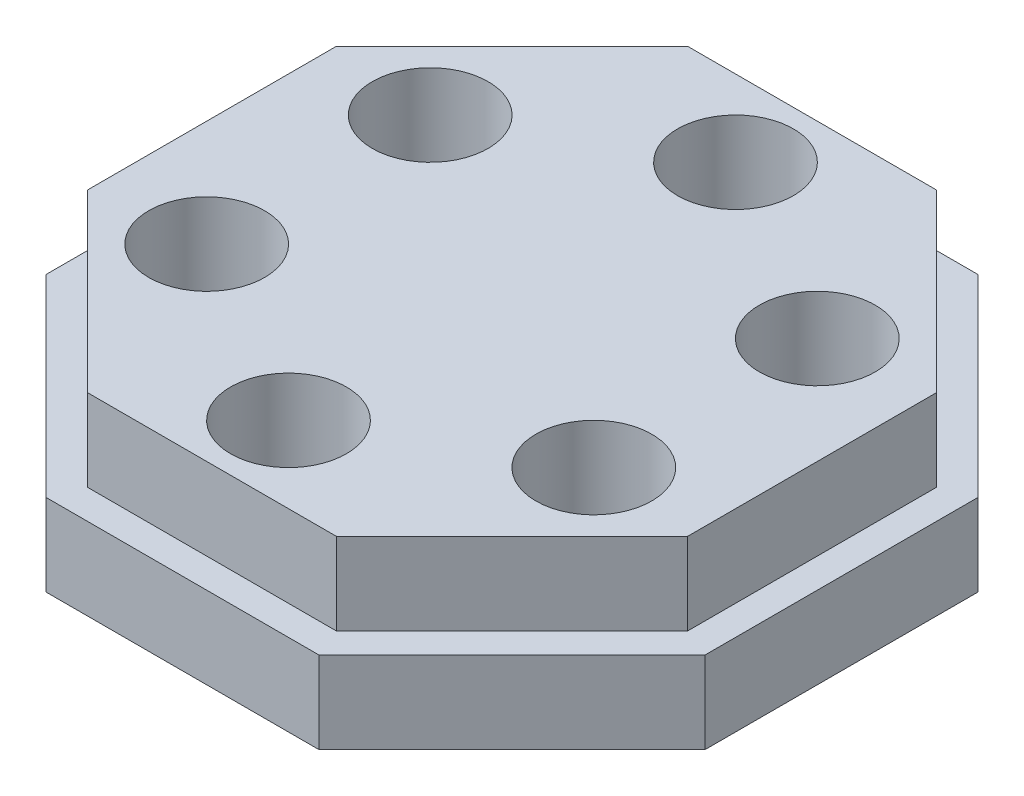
ISO-10303-21;
HEADER;
FILE_DESCRIPTION(('STEP AP214'),'2;1');
FILE_NAME('part.step','',(''),(''),'','','');
FILE_SCHEMA(('AUTOMOTIVE_DESIGN { 1 0 10303 214 1 1 1 1 }'));
ENDSEC;
DATA;
#1=APPLICATION_CONTEXT('core data for automotive mechanical design processes');
#2=APPLICATION_PROTOCOL_DEFINITION('international standard','automotive_design',2000,#1);
#3=PRODUCT_CONTEXT('',#1,'mechanical');
#4=PRODUCT('Part','Part','',(#3));
#5=PRODUCT_RELATED_PRODUCT_CATEGORY('part','',(#4));
#6=PRODUCT_DEFINITION_FORMATION('','',#4);
#7=PRODUCT_DEFINITION_CONTEXT('part definition',#1,'design');
#8=PRODUCT_DEFINITION('design','',#6,#7);
#9=PRODUCT_DEFINITION_SHAPE('','',#8);
#10=(LENGTH_UNIT() NAMED_UNIT(*) SI_UNIT(.MILLI.,.METRE.));
#11=(NAMED_UNIT(*) PLANE_ANGLE_UNIT() SI_UNIT($,.RADIAN.));
#12=(NAMED_UNIT(*) SI_UNIT($,.STERADIAN.) SOLID_ANGLE_UNIT());
#13=UNCERTAINTY_MEASURE_WITH_UNIT(LENGTH_MEASURE(1.E-05),#10,'distance_accuracy_value','');
#14=(GEOMETRIC_REPRESENTATION_CONTEXT(3) GLOBAL_UNCERTAINTY_ASSIGNED_CONTEXT((#13)) GLOBAL_UNIT_ASSIGNED_CONTEXT((#10,
#11,#12)) REPRESENTATION_CONTEXT('',''));
#15=CARTESIAN_POINT('',(0.,0.,0.));
#16=DIRECTION('',(0.,0.,1.));
#17=DIRECTION('',(1.,0.,0.));
#18=AXIS2_PLACEMENT_3D('',#15,#16,#17);
#19=CARTESIAN_POINT('',(0.,19.05,0.));
#20=DIRECTION('',(0.,-1.,0.));
#21=DIRECTION('',(0.,0.,-1.));
#22=AXIS2_PLACEMENT_3D('',#19,#20,#21);
#23=PLANE('',#22);
#24=DIRECTION('',(-0.707106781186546,0.,0.707106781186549));
#25=VECTOR('',#24,1.);
#26=CARTESIAN_POINT('',(-76.5809999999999,19.05,-31.7208888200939));
#27=LINE('',#26,#25);
#28=CARTESIAN_POINT('',(-31.720888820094,19.05,-76.5809999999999));
#29=VERTEX_POINT('',#28);
#30=CARTESIAN_POINT('',(-76.5809999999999,19.05,-31.7208888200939));
#31=VERTEX_POINT('',#30);
#32=EDGE_CURVE('E176',#29,#31,#27,.T.);
#33=ORIENTED_EDGE('',*,*,#32,.T.);
#34=DIRECTION('',(0.,0.,1.));
#35=VECTOR('',#34,1.);
#36=CARTESIAN_POINT('',(-76.5809999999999,19.05,31.7208888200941));
#37=LINE('',#36,#35);
#38=CARTESIAN_POINT('',(-76.5809999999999,19.05,31.7208888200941));
#39=VERTEX_POINT('',#38);
#40=EDGE_CURVE('E179',#31,#39,#37,.T.);
#41=ORIENTED_EDGE('',*,*,#40,.T.);
#42=DIRECTION('',(0.707106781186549,0.,0.707106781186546));
#43=VECTOR('',#42,1.);
#44=CARTESIAN_POINT('',(-31.7208888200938,19.05,76.581));
#45=LINE('',#44,#43);
#46=CARTESIAN_POINT('',(-31.7208888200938,19.05,76.581));
#47=VERTEX_POINT('',#46);
#48=EDGE_CURVE('E182',#39,#47,#45,.T.);
#49=ORIENTED_EDGE('',*,*,#48,.T.);
#50=DIRECTION('',(1.,0.,0.));
#51=VECTOR('',#50,1.);
#52=CARTESIAN_POINT('',(31.7208888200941,19.05,76.581));
#53=LINE('',#52,#51);
#54=CARTESIAN_POINT('',(31.7208888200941,19.05,76.581));
#55=VERTEX_POINT('',#54);
#56=EDGE_CURVE('E184',#47,#55,#53,.T.);
#57=ORIENTED_EDGE('',*,*,#56,.T.);
#58=DIRECTION('',(0.707106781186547,0.,-0.707106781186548));
#59=VECTOR('',#58,1.);
#60=CARTESIAN_POINT('',(76.5810000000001,19.05,31.720888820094));
#61=LINE('',#60,#59);
#62=CARTESIAN_POINT('',(76.5810000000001,19.05,31.720888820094));
#63=VERTEX_POINT('',#62);
#64=EDGE_CURVE('E186',#55,#63,#61,.T.);
#65=ORIENTED_EDGE('',*,*,#64,.T.);
#66=DIRECTION('',(0.,0.,-1.));
#67=VECTOR('',#66,1.);
#68=CARTESIAN_POINT('',(76.5810000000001,19.05,-31.720888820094));
#69=LINE('',#68,#67);
#70=CARTESIAN_POINT('',(76.5810000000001,19.05,-31.720888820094));
#71=VERTEX_POINT('',#70);
#72=EDGE_CURVE('E188',#63,#71,#69,.T.);
#73=ORIENTED_EDGE('',*,*,#72,.T.);
#74=DIRECTION('',(-0.707106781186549,0.,-0.707106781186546));
#75=VECTOR('',#74,1.);
#76=CARTESIAN_POINT('',(31.720888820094,19.05,-76.5809999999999));
#77=LINE('',#76,#75);
#78=CARTESIAN_POINT('',(31.720888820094,19.05,-76.5809999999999));
#79=VERTEX_POINT('',#78);
#80=EDGE_CURVE('E190',#71,#79,#77,.T.);
#81=ORIENTED_EDGE('',*,*,#80,.T.);
#82=DIRECTION('',(-1.,0.,0.));
#83=VECTOR('',#82,1.);
#84=CARTESIAN_POINT('',(-31.720888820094,19.05,-76.5809999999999));
#85=LINE('',#84,#83);
#86=EDGE_CURVE('E192',#79,#29,#85,.T.);
#87=ORIENTED_EDGE('',*,*,#86,.T.);
#88=EDGE_LOOP('',(#33,#41,#49,#57,#65,#73,#81,#87));
#89=FACE_BOUND('',#88,.T.);
#90=DIRECTION('',(-0.707106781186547,0.,0.707106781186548));
#91=VECTOR('',#90,1.);
#92=CARTESIAN_POINT('',(-69.723,19.05,-28.8802122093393));
#93=LINE('',#92,#91);
#94=CARTESIAN_POINT('',(-28.8802122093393,19.05,-69.723));
#95=VERTEX_POINT('',#94);
#96=CARTESIAN_POINT('',(-69.723,19.05,-28.8802122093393));
#97=VERTEX_POINT('',#96);
#98=EDGE_CURVE('E166',#95,#97,#93,.T.);
#99=ORIENTED_EDGE('',*,*,#98,.F.);
#100=DIRECTION('',(-1.,0.,0.));
#101=VECTOR('',#100,1.);
#102=CARTESIAN_POINT('',(-28.8802122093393,19.05,-69.723));
#103=LINE('',#102,#101);
#104=CARTESIAN_POINT('',(28.8802122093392,19.05,-69.723));
#105=VERTEX_POINT('',#104);
#106=EDGE_CURVE('E163',#105,#95,#103,.T.);
#107=ORIENTED_EDGE('',*,*,#106,.F.);
#108=DIRECTION('',(-0.707106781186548,0.,-0.707106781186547));
#109=VECTOR('',#108,1.);
#110=CARTESIAN_POINT('',(28.8802122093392,19.05,-69.723));
#111=LINE('',#110,#109);
#112=CARTESIAN_POINT('',(69.7229999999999,19.05,-28.8802122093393));
#113=VERTEX_POINT('',#112);
#114=EDGE_CURVE('E551',#113,#105,#111,.T.);
#115=ORIENTED_EDGE('',*,*,#114,.F.);
#116=DIRECTION('',(0.,0.,-1.));
#117=VECTOR('',#116,1.);
#118=CARTESIAN_POINT('',(69.7229999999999,19.05,-28.8802122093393));
#119=LINE('',#118,#117);
#120=CARTESIAN_POINT('',(69.7229999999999,19.05,28.8802122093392));
#121=VERTEX_POINT('',#120);
#122=EDGE_CURVE('E548',#121,#113,#119,.T.);
#123=ORIENTED_EDGE('',*,*,#122,.F.);
#124=DIRECTION('',(0.707106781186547,0.,-0.707106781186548));
#125=VECTOR('',#124,1.);
#126=CARTESIAN_POINT('',(69.7229999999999,19.05,28.8802122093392));
#127=LINE('',#126,#125);
#128=CARTESIAN_POINT('',(28.8802122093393,19.05,69.7229999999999));
#129=VERTEX_POINT('',#128);
#130=EDGE_CURVE('E545',#129,#121,#127,.T.);
#131=ORIENTED_EDGE('',*,*,#130,.F.);
#132=DIRECTION('',(1.,0.,0.));
#133=VECTOR('',#132,1.);
#134=CARTESIAN_POINT('',(28.8802122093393,19.05,69.7229999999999));
#135=LINE('',#134,#133);
#136=CARTESIAN_POINT('',(-28.8802122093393,19.05,69.7229999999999));
#137=VERTEX_POINT('',#136);
#138=EDGE_CURVE('E542',#137,#129,#135,.T.);
#139=ORIENTED_EDGE('',*,*,#138,.F.);
#140=DIRECTION('',(0.707106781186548,0.,0.707106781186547));
#141=VECTOR('',#140,1.);
#142=CARTESIAN_POINT('',(-28.8802122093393,19.05,69.7229999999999));
#143=LINE('',#142,#141);
#144=CARTESIAN_POINT('',(-69.723,19.05,28.8802122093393));
#145=VERTEX_POINT('',#144);
#146=EDGE_CURVE('E53',#145,#137,#143,.T.);
#147=ORIENTED_EDGE('',*,*,#146,.F.);
#148=DIRECTION('',(0.,0.,1.));
#149=VECTOR('',#148,1.);
#150=CARTESIAN_POINT('',(-69.723,19.05,28.8802122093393));
#151=LINE('',#150,#149);
#152=EDGE_CURVE('E48',#97,#145,#151,.T.);
#153=ORIENTED_EDGE('',*,*,#152,.F.);
#154=EDGE_LOOP('',(#99,#107,#115,#123,#131,#139,#147,#153));
#155=FACE_BOUND('',#154,.T.);
#156=ADVANCED_FACE('F33',(#89,#155),#23,.F.);
#157=CARTESIAN_POINT('',(-76.5809999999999,19.05,-31.7208888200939));
#158=DIRECTION('',(0.707106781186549,0.,0.707106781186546));
#159=DIRECTION('',(0.707106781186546,0.,-0.707106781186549));
#160=AXIS2_PLACEMENT_3D('',#157,#158,#159);
#161=PLANE('',#160);
#162=DIRECTION('',(-0.707106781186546,0.,0.707106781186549));
#163=VECTOR('',#162,1.);
#164=CARTESIAN_POINT('',(-76.5809999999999,0.,-31.7208888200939));
#165=LINE('',#164,#163);
#166=CARTESIAN_POINT('',(-31.720888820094,0.,-76.5809999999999));
#167=VERTEX_POINT('',#166);
#168=CARTESIAN_POINT('',(-76.5809999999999,0.,-31.7208888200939));
#169=VERTEX_POINT('',#168);
#170=EDGE_CURVE('E167',#167,#169,#165,.T.);
#171=ORIENTED_EDGE('',*,*,#170,.T.);
#172=DIRECTION('',(0.,-1.,0.));
#173=VECTOR('',#172,1.);
#174=CARTESIAN_POINT('',(-76.5809999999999,19.05,-31.7208888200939));
#175=LINE('',#174,#173);
#176=EDGE_CURVE('E11',#31,#169,#175,.T.);
#177=ORIENTED_EDGE('',*,*,#176,.F.);
#178=ORIENTED_EDGE('',*,*,#32,.F.);
#179=DIRECTION('',(0.,-1.,0.));
#180=VECTOR('',#179,1.);
#181=CARTESIAN_POINT('',(-31.720888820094,19.05,-76.5809999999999));
#182=LINE('',#181,#180);
#183=EDGE_CURVE('E193',#29,#167,#182,.T.);
#184=ORIENTED_EDGE('',*,*,#183,.T.);
#185=EDGE_LOOP('',(#171,#177,#178,#184));
#186=FACE_BOUND('',#185,.T.);
#187=ADVANCED_FACE('F35',(#186),#161,.F.);
#188=CARTESIAN_POINT('',(-76.5809999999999,19.05,31.7208888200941));
#189=DIRECTION('',(1.,0.,0.));
#190=DIRECTION('',(0.,0.,-1.));
#191=AXIS2_PLACEMENT_3D('',#188,#189,#190);
#192=PLANE('',#191);
#193=DIRECTION('',(0.,0.,1.));
#194=VECTOR('',#193,1.);
#195=CARTESIAN_POINT('',(-76.5809999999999,0.,31.7208888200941));
#196=LINE('',#195,#194);
#197=CARTESIAN_POINT('',(-76.5809999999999,0.,31.7208888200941));
#198=VERTEX_POINT('',#197);
#199=EDGE_CURVE('E170',#169,#198,#196,.T.);
#200=ORIENTED_EDGE('',*,*,#199,.T.);
#201=DIRECTION('',(0.,-1.,0.));
#202=VECTOR('',#201,1.);
#203=CARTESIAN_POINT('',(-76.5809999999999,19.05,31.7208888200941));
#204=LINE('',#203,#202);
#205=EDGE_CURVE('E41',#39,#198,#204,.T.);
#206=ORIENTED_EDGE('',*,*,#205,.F.);
#207=ORIENTED_EDGE('',*,*,#40,.F.);
#208=ORIENTED_EDGE('',*,*,#176,.T.);
#209=EDGE_LOOP('',(#200,#206,#207,#208));
#210=FACE_BOUND('',#209,.T.);
#211=ADVANCED_FACE('F250',(#210),#192,.F.);
#212=CARTESIAN_POINT('',(-31.7208888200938,19.05,76.581));
#213=DIRECTION('',(0.707106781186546,0.,-0.707106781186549));
#214=DIRECTION('',(-0.707106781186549,0.,-0.707106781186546));
#215=AXIS2_PLACEMENT_3D('',#212,#213,#214);
#216=PLANE('',#215);
#217=DIRECTION('',(0.707106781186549,0.,0.707106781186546));
#218=VECTOR('',#217,1.);
#219=CARTESIAN_POINT('',(-31.7208888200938,0.,76.581));
#220=LINE('',#219,#218);
#221=CARTESIAN_POINT('',(-31.7208888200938,0.,76.581));
#222=VERTEX_POINT('',#221);
#223=EDGE_CURVE('E196',#198,#222,#220,.T.);
#224=ORIENTED_EDGE('',*,*,#223,.T.);
#225=DIRECTION('',(0.,-1.,0.));
#226=VECTOR('',#225,1.);
#227=CARTESIAN_POINT('',(-31.7208888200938,19.05,76.581));
#228=LINE('',#227,#226);
#229=EDGE_CURVE('E221',#47,#222,#228,.T.);
#230=ORIENTED_EDGE('',*,*,#229,.F.);
#231=ORIENTED_EDGE('',*,*,#48,.F.);
#232=ORIENTED_EDGE('',*,*,#205,.T.);
#233=EDGE_LOOP('',(#224,#230,#231,#232));
#234=FACE_BOUND('',#233,.T.);
#235=ADVANCED_FACE('F228',(#234),#216,.F.);
#236=CARTESIAN_POINT('',(31.7208888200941,19.05,76.581));
#237=DIRECTION('',(0.,0.,-1.));
#238=DIRECTION('',(-1.,0.,0.));
#239=AXIS2_PLACEMENT_3D('',#236,#237,#238);
#240=PLANE('',#239);
#241=DIRECTION('',(1.,0.,0.));
#242=VECTOR('',#241,1.);
#243=CARTESIAN_POINT('',(31.7208888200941,0.,76.581));
#244=LINE('',#243,#242);
#245=CARTESIAN_POINT('',(31.7208888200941,0.,76.581));
#246=VERTEX_POINT('',#245);
#247=EDGE_CURVE('E198',#222,#246,#244,.T.);
#248=ORIENTED_EDGE('',*,*,#247,.T.);
#249=DIRECTION('',(0.,-1.,0.));
#250=VECTOR('',#249,1.);
#251=CARTESIAN_POINT('',(31.7208888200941,19.05,76.581));
#252=LINE('',#251,#250);
#253=EDGE_CURVE('E218',#55,#246,#252,.T.);
#254=ORIENTED_EDGE('',*,*,#253,.F.);
#255=ORIENTED_EDGE('',*,*,#56,.F.);
#256=ORIENTED_EDGE('',*,*,#229,.T.);
#257=EDGE_LOOP('',(#248,#254,#255,#256));
#258=FACE_BOUND('',#257,.T.);
#259=ADVANCED_FACE('F239',(#258),#240,.F.);
#260=CARTESIAN_POINT('',(76.5810000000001,19.05,31.720888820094));
#261=DIRECTION('',(-0.707106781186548,0.,-0.707106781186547));
#262=DIRECTION('',(-0.707106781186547,0.,0.707106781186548));
#263=AXIS2_PLACEMENT_3D('',#260,#261,#262);
#264=PLANE('',#263);
#265=DIRECTION('',(0.707106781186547,0.,-0.707106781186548));
#266=VECTOR('',#265,1.);
#267=CARTESIAN_POINT('',(76.5810000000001,0.,31.720888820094));
#268=LINE('',#267,#266);
#269=CARTESIAN_POINT('',(76.5810000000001,0.,31.720888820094));
#270=VERTEX_POINT('',#269);
#271=EDGE_CURVE('E200',#246,#270,#268,.T.);
#272=ORIENTED_EDGE('',*,*,#271,.T.);
#273=DIRECTION('',(0.,-1.,0.));
#274=VECTOR('',#273,1.);
#275=CARTESIAN_POINT('',(76.5810000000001,19.05,31.720888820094));
#276=LINE('',#275,#274);
#277=EDGE_CURVE('E215',#63,#270,#276,.T.);
#278=ORIENTED_EDGE('',*,*,#277,.F.);
#279=ORIENTED_EDGE('',*,*,#64,.F.);
#280=ORIENTED_EDGE('',*,*,#253,.T.);
#281=EDGE_LOOP('',(#272,#278,#279,#280));
#282=FACE_BOUND('',#281,.T.);
#283=ADVANCED_FACE('F243',(#282),#264,.F.);
#284=CARTESIAN_POINT('',(76.5810000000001,19.05,-31.720888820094));
#285=DIRECTION('',(-1.,0.,0.));
#286=DIRECTION('',(0.,0.,1.));
#287=AXIS2_PLACEMENT_3D('',#284,#285,#286);
#288=PLANE('',#287);
#289=DIRECTION('',(0.,0.,-1.));
#290=VECTOR('',#289,1.);
#291=CARTESIAN_POINT('',(76.5810000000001,0.,-31.720888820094));
#292=LINE('',#291,#290);
#293=CARTESIAN_POINT('',(76.5810000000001,0.,-31.720888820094));
#294=VERTEX_POINT('',#293);
#295=EDGE_CURVE('E202',#270,#294,#292,.T.);
#296=ORIENTED_EDGE('',*,*,#295,.T.);
#297=DIRECTION('',(0.,-1.,0.));
#298=VECTOR('',#297,1.);
#299=CARTESIAN_POINT('',(76.5810000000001,19.05,-31.720888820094));
#300=LINE('',#299,#298);
#301=EDGE_CURVE('E212',#71,#294,#300,.T.);
#302=ORIENTED_EDGE('',*,*,#301,.F.);
#303=ORIENTED_EDGE('',*,*,#72,.F.);
#304=ORIENTED_EDGE('',*,*,#277,.T.);
#305=EDGE_LOOP('',(#296,#302,#303,#304));
#306=FACE_BOUND('',#305,.T.);
#307=ADVANCED_FACE('F263',(#306),#288,.F.);
#308=CARTESIAN_POINT('',(31.720888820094,19.05,-76.5809999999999));
#309=DIRECTION('',(-0.707106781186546,0.,0.707106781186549));
#310=DIRECTION('',(0.707106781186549,0.,0.707106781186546));
#311=AXIS2_PLACEMENT_3D('',#308,#309,#310);
#312=PLANE('',#311);
#313=DIRECTION('',(-0.707106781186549,0.,-0.707106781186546));
#314=VECTOR('',#313,1.);
#315=CARTESIAN_POINT('',(31.720888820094,0.,-76.5809999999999));
#316=LINE('',#315,#314);
#317=CARTESIAN_POINT('',(31.720888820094,0.,-76.5809999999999));
#318=VERTEX_POINT('',#317);
#319=EDGE_CURVE('E204',#294,#318,#316,.T.);
#320=ORIENTED_EDGE('',*,*,#319,.T.);
#321=DIRECTION('',(0.,-1.,0.));
#322=VECTOR('',#321,1.);
#323=CARTESIAN_POINT('',(31.720888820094,19.05,-76.5809999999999));
#324=LINE('',#323,#322);
#325=EDGE_CURVE('E209',#79,#318,#324,.T.);
#326=ORIENTED_EDGE('',*,*,#325,.F.);
#327=ORIENTED_EDGE('',*,*,#80,.F.);
#328=ORIENTED_EDGE('',*,*,#301,.T.);
#329=EDGE_LOOP('',(#320,#326,#327,#328));
#330=FACE_BOUND('',#329,.T.);
#331=ADVANCED_FACE('F261',(#330),#312,.F.);
#332=CARTESIAN_POINT('',(-31.720888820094,19.05,-76.5809999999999));
#333=DIRECTION('',(0.,0.,1.));
#334=DIRECTION('',(1.,0.,0.));
#335=AXIS2_PLACEMENT_3D('',#332,#333,#334);
#336=PLANE('',#335);
#337=DIRECTION('',(-1.,0.,0.));
#338=VECTOR('',#337,1.);
#339=CARTESIAN_POINT('',(-31.720888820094,0.,-76.5809999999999));
#340=LINE('',#339,#338);
#341=EDGE_CURVE('E180',#318,#167,#340,.T.);
#342=ORIENTED_EDGE('',*,*,#341,.T.);
#343=ORIENTED_EDGE('',*,*,#183,.F.);
#344=ORIENTED_EDGE('',*,*,#86,.F.);
#345=ORIENTED_EDGE('',*,*,#325,.T.);
#346=EDGE_LOOP('',(#342,#343,#344,#345));
#347=FACE_BOUND('',#346,.T.);
#348=ADVANCED_FACE('F256',(#347),#336,.F.);
#349=CARTESIAN_POINT('',(0.,0.,0.));
#350=DIRECTION('',(0.,-1.,0.));
#351=DIRECTION('',(0.,0.,-1.));
#352=AXIS2_PLACEMENT_3D('',#349,#350,#351);
#353=PLANE('',#352);
#354=CARTESIAN_POINT('',(-44.9839575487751,0.,-25.9715));
#355=DIRECTION('',(0.,1.,0.));
#356=DIRECTION('',(0.,0.,1.));
#357=AXIS2_PLACEMENT_3D('',#354,#355,#356);
#358=CIRCLE('',#357,13.4620000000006);
#359=CARTESIAN_POINT('',(-44.9839575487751,0.,-12.5094999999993));
#360=VERTEX_POINT('',#359);
#361=EDGE_CURVE('E491',#360,#360,#358,.T.);
#362=ORIENTED_EDGE('',*,*,#361,.T.);
#363=EDGE_LOOP('',(#362));
#364=FACE_BOUND('',#363,.T.);
#365=CARTESIAN_POINT('',(-44.9839575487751,0.,25.9715));
#366=DIRECTION('',(0.,1.,0.));
#367=DIRECTION('',(0.,0.,1.));
#368=AXIS2_PLACEMENT_3D('',#365,#366,#367);
#369=CIRCLE('',#368,13.4620000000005);
#370=CARTESIAN_POINT('',(-44.9839575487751,0.,39.4335000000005));
#371=VERTEX_POINT('',#370);
#372=EDGE_CURVE('E499',#371,#371,#369,.T.);
#373=ORIENTED_EDGE('',*,*,#372,.T.);
#374=EDGE_LOOP('',(#373));
#375=FACE_BOUND('',#374,.T.);
#376=CARTESIAN_POINT('',(1.09941290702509E-12,0.,51.9430000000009));
#377=DIRECTION('',(0.,1.,0.));
#378=DIRECTION('',(0.,0.,1.));
#379=AXIS2_PLACEMENT_3D('',#376,#377,#378);
#380=CIRCLE('',#379,13.4620000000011);
#381=CARTESIAN_POINT('',(1.09941290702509E-12,0.,65.4050000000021));
#382=VERTEX_POINT('',#381);
#383=EDGE_CURVE('E505',#382,#382,#380,.T.);
#384=ORIENTED_EDGE('',*,*,#383,.T.);
#385=EDGE_LOOP('',(#384));
#386=FACE_BOUND('',#385,.T.);
#387=CARTESIAN_POINT('',(44.9839575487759,0.,25.9715000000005));
#388=DIRECTION('',(0.,1.,0.));
#389=DIRECTION('',(0.,0.,1.));
#390=AXIS2_PLACEMENT_3D('',#387,#388,#389);
#391=CIRCLE('',#390,13.462);
#392=CARTESIAN_POINT('',(44.9839575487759,0.,39.4335000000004));
#393=VERTEX_POINT('',#392);
#394=EDGE_CURVE('E511',#393,#393,#391,.T.);
#395=ORIENTED_EDGE('',*,*,#394,.T.);
#396=EDGE_LOOP('',(#395));
#397=FACE_BOUND('',#396,.T.);
#398=CARTESIAN_POINT('',(44.9839575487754,0.,-25.9714999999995));
#399=DIRECTION('',(0.,1.,0.));
#400=DIRECTION('',(0.,0.,1.));
#401=AXIS2_PLACEMENT_3D('',#398,#399,#400);
#402=CIRCLE('',#401,13.4619999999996);
#403=CARTESIAN_POINT('',(44.9839575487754,0.,-12.5094999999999));
#404=VERTEX_POINT('',#403);
#405=EDGE_CURVE('E517',#404,#404,#402,.T.);
#406=ORIENTED_EDGE('',*,*,#405,.T.);
#407=EDGE_LOOP('',(#406));
#408=FACE_BOUND('',#407,.T.);
#409=CARTESIAN_POINT('',(0.,0.,-51.942999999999));
#410=DIRECTION('',(0.,1.,0.));
#411=DIRECTION('',(0.,0.,1.));
#412=AXIS2_PLACEMENT_3D('',#409,#410,#411);
#413=CIRCLE('',#412,13.4620000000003);
#414=CARTESIAN_POINT('',(0.,0.,-38.4809999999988));
#415=VERTEX_POINT('',#414);
#416=EDGE_CURVE('E523',#415,#415,#413,.T.);
#417=ORIENTED_EDGE('',*,*,#416,.T.);
#418=EDGE_LOOP('',(#417));
#419=FACE_BOUND('',#418,.T.);
#420=ORIENTED_EDGE('',*,*,#170,.F.);
#421=ORIENTED_EDGE('',*,*,#341,.F.);
#422=ORIENTED_EDGE('',*,*,#319,.F.);
#423=ORIENTED_EDGE('',*,*,#295,.F.);
#424=ORIENTED_EDGE('',*,*,#271,.F.);
#425=ORIENTED_EDGE('',*,*,#247,.F.);
#426=ORIENTED_EDGE('',*,*,#223,.F.);
#427=ORIENTED_EDGE('',*,*,#199,.F.);
#428=EDGE_LOOP('',(#420,#421,#422,#423,#424,#425,#426,#427));
#429=FACE_BOUND('',#428,.T.);
#430=ADVANCED_FACE('F234',(#364,#375,#386,#397,#408,#419,#429),#353,.T.);
#431=CARTESIAN_POINT('',(-69.723,38.1,-28.8802122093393));
#432=DIRECTION('',(0.707106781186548,0.,0.707106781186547));
#433=DIRECTION('',(0.707106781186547,0.,-0.707106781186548));
#434=AXIS2_PLACEMENT_3D('',#431,#432,#433);
#435=PLANE('',#434);
#436=ORIENTED_EDGE('',*,*,#98,.T.);
#437=DIRECTION('',(0.,-1.,0.));
#438=VECTOR('',#437,1.);
#439=CARTESIAN_POINT('',(-69.723,38.1,-28.8802122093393));
#440=LINE('',#439,#438);
#441=CARTESIAN_POINT('',(-69.723,38.1,-28.8802122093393));
#442=VERTEX_POINT('',#441);
#443=EDGE_CURVE('E147',#442,#97,#440,.T.);
#444=ORIENTED_EDGE('',*,*,#443,.F.);
#445=DIRECTION('',(-0.707106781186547,0.,0.707106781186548));
#446=VECTOR('',#445,1.);
#447=CARTESIAN_POINT('',(-69.723,38.1,-28.8802122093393));
#448=LINE('',#447,#446);
#449=CARTESIAN_POINT('',(-28.8802122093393,38.1,-69.723));
#450=VERTEX_POINT('',#449);
#451=EDGE_CURVE('E154',#450,#442,#448,.T.);
#452=ORIENTED_EDGE('',*,*,#451,.F.);
#453=DIRECTION('',(0.,-1.,0.));
#454=VECTOR('',#453,1.);
#455=CARTESIAN_POINT('',(-28.8802122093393,38.1,-69.723));
#456=LINE('',#455,#454);
#457=EDGE_CURVE('E538',#450,#95,#456,.T.);
#458=ORIENTED_EDGE('',*,*,#457,.T.);
#459=EDGE_LOOP('',(#436,#444,#452,#458));
#460=FACE_BOUND('',#459,.T.);
#461=ADVANCED_FACE('F165',(#460),#435,.F.);
#462=CARTESIAN_POINT('',(-69.723,38.1,28.8802122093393));
#463=DIRECTION('',(1.,0.,0.));
#464=DIRECTION('',(0.,0.,-1.));
#465=AXIS2_PLACEMENT_3D('',#462,#463,#464);
#466=PLANE('',#465);
#467=ORIENTED_EDGE('',*,*,#152,.T.);
#468=DIRECTION('',(0.,-1.,0.));
#469=VECTOR('',#468,1.);
#470=CARTESIAN_POINT('',(-69.723,38.1,28.8802122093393));
#471=LINE('',#470,#469);
#472=CARTESIAN_POINT('',(-69.723,38.1,28.8802122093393));
#473=VERTEX_POINT('',#472);
#474=EDGE_CURVE('E150',#473,#145,#471,.T.);
#475=ORIENTED_EDGE('',*,*,#474,.F.);
#476=DIRECTION('',(0.,0.,1.));
#477=VECTOR('',#476,1.);
#478=CARTESIAN_POINT('',(-69.723,38.1,28.8802122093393));
#479=LINE('',#478,#477);
#480=EDGE_CURVE('E143',#442,#473,#479,.T.);
#481=ORIENTED_EDGE('',*,*,#480,.F.);
#482=ORIENTED_EDGE('',*,*,#443,.T.);
#483=EDGE_LOOP('',(#467,#475,#481,#482));
#484=FACE_BOUND('',#483,.T.);
#485=ADVANCED_FACE('F145',(#484),#466,.F.);
#486=CARTESIAN_POINT('',(-28.8802122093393,38.1,69.7229999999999));
#487=DIRECTION('',(0.707106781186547,0.,-0.707106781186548));
#488=DIRECTION('',(-0.707106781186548,0.,-0.707106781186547));
#489=AXIS2_PLACEMENT_3D('',#486,#487,#488);
#490=PLANE('',#489);
#491=ORIENTED_EDGE('',*,*,#146,.T.);
#492=DIRECTION('',(0.,-1.,0.));
#493=VECTOR('',#492,1.);
#494=CARTESIAN_POINT('',(-28.8802122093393,38.1,69.7229999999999));
#495=LINE('',#494,#493);
#496=CARTESIAN_POINT('',(-28.8802122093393,38.1,69.7229999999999));
#497=VERTEX_POINT('',#496);
#498=EDGE_CURVE('E172',#497,#137,#495,.T.);
#499=ORIENTED_EDGE('',*,*,#498,.F.);
#500=DIRECTION('',(0.707106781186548,0.,0.707106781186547));
#501=VECTOR('',#500,1.);
#502=CARTESIAN_POINT('',(-28.8802122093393,38.1,69.7229999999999));
#503=LINE('',#502,#501);
#504=EDGE_CURVE('E153',#473,#497,#503,.T.);
#505=ORIENTED_EDGE('',*,*,#504,.F.);
#506=ORIENTED_EDGE('',*,*,#474,.T.);
#507=EDGE_LOOP('',(#491,#499,#505,#506));
#508=FACE_BOUND('',#507,.T.);
#509=ADVANCED_FACE('F305',(#508),#490,.F.);
#510=CARTESIAN_POINT('',(28.8802122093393,38.1,69.7229999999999));
#511=DIRECTION('',(0.,0.,-1.));
#512=DIRECTION('',(-1.,0.,0.));
#513=AXIS2_PLACEMENT_3D('',#510,#511,#512);
#514=PLANE('',#513);
#515=ORIENTED_EDGE('',*,*,#138,.T.);
#516=DIRECTION('',(0.,-1.,0.));
#517=VECTOR('',#516,1.);
#518=CARTESIAN_POINT('',(28.8802122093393,38.1,69.7229999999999));
#519=LINE('',#518,#517);
#520=CARTESIAN_POINT('',(28.8802122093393,38.1,69.7229999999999));
#521=VERTEX_POINT('',#520);
#522=EDGE_CURVE('E566',#521,#129,#519,.T.);
#523=ORIENTED_EDGE('',*,*,#522,.F.);
#524=DIRECTION('',(1.,0.,0.));
#525=VECTOR('',#524,1.);
#526=CARTESIAN_POINT('',(28.8802122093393,38.1,69.7229999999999));
#527=LINE('',#526,#525);
#528=EDGE_CURVE('E529',#497,#521,#527,.T.);
#529=ORIENTED_EDGE('',*,*,#528,.F.);
#530=ORIENTED_EDGE('',*,*,#498,.T.);
#531=EDGE_LOOP('',(#515,#523,#529,#530));
#532=FACE_BOUND('',#531,.T.);
#533=ADVANCED_FACE('F311',(#532),#514,.F.);
#534=CARTESIAN_POINT('',(69.7229999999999,38.1,28.8802122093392));
#535=DIRECTION('',(-0.707106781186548,0.,-0.707106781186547));
#536=DIRECTION('',(-0.707106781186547,0.,0.707106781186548));
#537=AXIS2_PLACEMENT_3D('',#534,#535,#536);
#538=PLANE('',#537);
#539=ORIENTED_EDGE('',*,*,#130,.T.);
#540=DIRECTION('',(0.,-1.,0.));
#541=VECTOR('',#540,1.);
#542=CARTESIAN_POINT('',(69.7229999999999,38.1,28.8802122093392));
#543=LINE('',#542,#541);
#544=CARTESIAN_POINT('',(69.7229999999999,38.1,28.8802122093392));
#545=VERTEX_POINT('',#544);
#546=EDGE_CURVE('E563',#545,#121,#543,.T.);
#547=ORIENTED_EDGE('',*,*,#546,.F.);
#548=DIRECTION('',(0.707106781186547,0.,-0.707106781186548));
#549=VECTOR('',#548,1.);
#550=CARTESIAN_POINT('',(69.7229999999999,38.1,28.8802122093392));
#551=LINE('',#550,#549);
#552=EDGE_CURVE('E531',#521,#545,#551,.T.);
#553=ORIENTED_EDGE('',*,*,#552,.F.);
#554=ORIENTED_EDGE('',*,*,#522,.T.);
#555=EDGE_LOOP('',(#539,#547,#553,#554));
#556=FACE_BOUND('',#555,.T.);
#557=ADVANCED_FACE('F319',(#556),#538,.F.);
#558=CARTESIAN_POINT('',(69.7229999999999,38.1,-28.8802122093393));
#559=DIRECTION('',(-1.,0.,0.));
#560=DIRECTION('',(0.,0.,1.));
#561=AXIS2_PLACEMENT_3D('',#558,#559,#560);
#562=PLANE('',#561);
#563=ORIENTED_EDGE('',*,*,#122,.T.);
#564=DIRECTION('',(0.,-1.,0.));
#565=VECTOR('',#564,1.);
#566=CARTESIAN_POINT('',(69.7229999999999,38.1,-28.8802122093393));
#567=LINE('',#566,#565);
#568=CARTESIAN_POINT('',(69.7229999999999,38.1,-28.8802122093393));
#569=VERTEX_POINT('',#568);
#570=EDGE_CURVE('E560',#569,#113,#567,.T.);
#571=ORIENTED_EDGE('',*,*,#570,.F.);
#572=DIRECTION('',(0.,0.,-1.));
#573=VECTOR('',#572,1.);
#574=CARTESIAN_POINT('',(69.7229999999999,38.1,-28.8802122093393));
#575=LINE('',#574,#573);
#576=EDGE_CURVE('E533',#545,#569,#575,.T.);
#577=ORIENTED_EDGE('',*,*,#576,.F.);
#578=ORIENTED_EDGE('',*,*,#546,.T.);
#579=EDGE_LOOP('',(#563,#571,#577,#578));
#580=FACE_BOUND('',#579,.T.);
#581=ADVANCED_FACE('F327',(#580),#562,.F.);
#582=CARTESIAN_POINT('',(28.8802122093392,38.1,-69.723));
#583=DIRECTION('',(-0.707106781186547,0.,0.707106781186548));
#584=DIRECTION('',(0.707106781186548,0.,0.707106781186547));
#585=AXIS2_PLACEMENT_3D('',#582,#583,#584);
#586=PLANE('',#585);
#587=ORIENTED_EDGE('',*,*,#114,.T.);
#588=DIRECTION('',(0.,-1.,0.));
#589=VECTOR('',#588,1.);
#590=CARTESIAN_POINT('',(28.8802122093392,38.1,-69.723));
#591=LINE('',#590,#589);
#592=CARTESIAN_POINT('',(28.8802122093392,38.1,-69.723));
#593=VERTEX_POINT('',#592);
#594=EDGE_CURVE('E557',#593,#105,#591,.T.);
#595=ORIENTED_EDGE('',*,*,#594,.F.);
#596=DIRECTION('',(-0.707106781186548,0.,-0.707106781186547));
#597=VECTOR('',#596,1.);
#598=CARTESIAN_POINT('',(28.8802122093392,38.1,-69.723));
#599=LINE('',#598,#597);
#600=EDGE_CURVE('E535',#569,#593,#599,.T.);
#601=ORIENTED_EDGE('',*,*,#600,.F.);
#602=ORIENTED_EDGE('',*,*,#570,.T.);
#603=EDGE_LOOP('',(#587,#595,#601,#602));
#604=FACE_BOUND('',#603,.T.);
#605=ADVANCED_FACE('F335',(#604),#586,.F.);
#606=CARTESIAN_POINT('',(-28.8802122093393,38.1,-69.723));
#607=DIRECTION('',(0.,0.,1.));
#608=DIRECTION('',(1.,0.,0.));
#609=AXIS2_PLACEMENT_3D('',#606,#607,#608);
#610=PLANE('',#609);
#611=ORIENTED_EDGE('',*,*,#106,.T.);
#612=ORIENTED_EDGE('',*,*,#457,.F.);
#613=DIRECTION('',(-1.,0.,0.));
#614=VECTOR('',#613,1.);
#615=CARTESIAN_POINT('',(-28.8802122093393,38.1,-69.723));
#616=LINE('',#615,#614);
#617=EDGE_CURVE('E159',#593,#450,#616,.T.);
#618=ORIENTED_EDGE('',*,*,#617,.F.);
#619=ORIENTED_EDGE('',*,*,#594,.T.);
#620=EDGE_LOOP('',(#611,#612,#618,#619));
#621=FACE_BOUND('',#620,.T.);
#622=ADVANCED_FACE('F343',(#621),#610,.F.);
#623=CARTESIAN_POINT('',(0.,38.1,0.));
#624=DIRECTION('',(0.,-1.,0.));
#625=DIRECTION('',(0.,0.,-1.));
#626=AXIS2_PLACEMENT_3D('',#623,#624,#625);
#627=PLANE('',#626);
#628=CARTESIAN_POINT('',(-44.9839575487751,38.1,-25.9715));
#629=DIRECTION('',(0.,1.,0.));
#630=DIRECTION('',(0.,0.,1.));
#631=AXIS2_PLACEMENT_3D('',#628,#629,#630);
#632=CIRCLE('',#631,13.4620000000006);
#633=CARTESIAN_POINT('',(-44.9839575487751,38.1,-12.5094999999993));
#634=VERTEX_POINT('',#633);
#635=EDGE_CURVE('E494',#634,#634,#632,.T.);
#636=ORIENTED_EDGE('',*,*,#635,.F.);
#637=EDGE_LOOP('',(#636));
#638=FACE_BOUND('',#637,.T.);
#639=CARTESIAN_POINT('',(-44.9839575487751,38.1,25.9715));
#640=DIRECTION('',(0.,1.,0.));
#641=DIRECTION('',(0.,0.,1.));
#642=AXIS2_PLACEMENT_3D('',#639,#640,#641);
#643=CIRCLE('',#642,13.4620000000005);
#644=CARTESIAN_POINT('',(-44.9839575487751,38.1,39.4335000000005));
#645=VERTEX_POINT('',#644);
#646=EDGE_CURVE('E496',#645,#645,#643,.T.);
#647=ORIENTED_EDGE('',*,*,#646,.F.);
#648=EDGE_LOOP('',(#647));
#649=FACE_BOUND('',#648,.T.);
#650=CARTESIAN_POINT('',(1.09941290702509E-12,38.1,51.9430000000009));
#651=DIRECTION('',(0.,1.,0.));
#652=DIRECTION('',(0.,0.,1.));
#653=AXIS2_PLACEMENT_3D('',#650,#651,#652);
#654=CIRCLE('',#653,13.4620000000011);
#655=CARTESIAN_POINT('',(1.09941290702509E-12,38.1,65.4050000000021));
#656=VERTEX_POINT('',#655);
#657=EDGE_CURVE('E502',#656,#656,#654,.T.);
#658=ORIENTED_EDGE('',*,*,#657,.F.);
#659=EDGE_LOOP('',(#658));
#660=FACE_BOUND('',#659,.T.);
#661=CARTESIAN_POINT('',(44.9839575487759,38.1,25.9715000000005));
#662=DIRECTION('',(0.,1.,0.));
#663=DIRECTION('',(0.,0.,1.));
#664=AXIS2_PLACEMENT_3D('',#661,#662,#663);
#665=CIRCLE('',#664,13.462);
#666=CARTESIAN_POINT('',(44.9839575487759,38.1,39.4335000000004));
#667=VERTEX_POINT('',#666);
#668=EDGE_CURVE('E508',#667,#667,#665,.T.);
#669=ORIENTED_EDGE('',*,*,#668,.F.);
#670=EDGE_LOOP('',(#669));
#671=FACE_BOUND('',#670,.T.);
#672=CARTESIAN_POINT('',(44.9839575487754,38.1,-25.9714999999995));
#673=DIRECTION('',(0.,1.,0.));
#674=DIRECTION('',(0.,0.,1.));
#675=AXIS2_PLACEMENT_3D('',#672,#673,#674);
#676=CIRCLE('',#675,13.4619999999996);
#677=CARTESIAN_POINT('',(44.9839575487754,38.1,-12.5094999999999));
#678=VERTEX_POINT('',#677);
#679=EDGE_CURVE('E514',#678,#678,#676,.T.);
#680=ORIENTED_EDGE('',*,*,#679,.F.);
#681=EDGE_LOOP('',(#680));
#682=FACE_BOUND('',#681,.T.);
#683=CARTESIAN_POINT('',(0.,38.1,-51.942999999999));
#684=DIRECTION('',(0.,1.,0.));
#685=DIRECTION('',(0.,0.,1.));
#686=AXIS2_PLACEMENT_3D('',#683,#684,#685);
#687=CIRCLE('',#686,13.4620000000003);
#688=CARTESIAN_POINT('',(0.,38.1,-38.4809999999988));
#689=VERTEX_POINT('',#688);
#690=EDGE_CURVE('E520',#689,#689,#687,.T.);
#691=ORIENTED_EDGE('',*,*,#690,.F.);
#692=EDGE_LOOP('',(#691));
#693=FACE_BOUND('',#692,.T.);
#694=ORIENTED_EDGE('',*,*,#451,.T.);
#695=ORIENTED_EDGE('',*,*,#480,.T.);
#696=ORIENTED_EDGE('',*,*,#504,.T.);
#697=ORIENTED_EDGE('',*,*,#528,.T.);
#698=ORIENTED_EDGE('',*,*,#552,.T.);
#699=ORIENTED_EDGE('',*,*,#576,.T.);
#700=ORIENTED_EDGE('',*,*,#600,.T.);
#701=ORIENTED_EDGE('',*,*,#617,.T.);
#702=EDGE_LOOP('',(#694,#695,#696,#697,#698,#699,#700,#701));
#703=FACE_BOUND('',#702,.T.);
#704=ADVANCED_FACE('F157',(#638,#649,#660,#671,#682,#693,#703),#627,.F.);
#705=CARTESIAN_POINT('',(0.,0.,-51.942999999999));
#706=DIRECTION('',(0.,1.,0.));
#707=DIRECTION('',(0.,0.,1.));
#708=AXIS2_PLACEMENT_3D('',#705,#706,#707);
#709=CYLINDRICAL_SURFACE('',#708,13.4620000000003);
#710=CARTESIAN_POINT('',(0.,0.,-38.4809999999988));
#711=CARTESIAN_POINT('',(0.,0.396875,-38.4809999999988));
#712=CARTESIAN_POINT('',(0.,0.79375,-38.4809999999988));
#713=CARTESIAN_POINT('',(0.,1.5875,-38.4809999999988));
#714=CARTESIAN_POINT('',(0.,1.984375,-38.4809999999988));
#715=CARTESIAN_POINT('',(0.,2.778125,-38.4809999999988));
#716=CARTESIAN_POINT('',(0.,3.175,-38.4809999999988));
#717=CARTESIAN_POINT('',(0.,3.96875,-38.4809999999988));
#718=CARTESIAN_POINT('',(0.,4.365625,-38.4809999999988));
#719=CARTESIAN_POINT('',(0.,5.159375,-38.4809999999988));
#720=CARTESIAN_POINT('',(0.,5.55625,-38.4809999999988));
#721=CARTESIAN_POINT('',(0.,6.35,-38.4809999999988));
#722=CARTESIAN_POINT('',(0.,6.746875,-38.4809999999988));
#723=CARTESIAN_POINT('',(0.,7.540625,-38.4809999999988));
#724=CARTESIAN_POINT('',(0.,7.9375,-38.4809999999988));
#725=CARTESIAN_POINT('',(0.,8.73125,-38.4809999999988));
#726=CARTESIAN_POINT('',(0.,9.128125,-38.4809999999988));
#727=CARTESIAN_POINT('',(0.,9.921875,-38.4809999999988));
#728=CARTESIAN_POINT('',(0.,10.31875,-38.4809999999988));
#729=CARTESIAN_POINT('',(0.,11.1125,-38.4809999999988));
#730=CARTESIAN_POINT('',(0.,11.509375,-38.4809999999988));
#731=CARTESIAN_POINT('',(0.,12.303125,-38.4809999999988));
#732=CARTESIAN_POINT('',(0.,12.7,-38.4809999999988));
#733=CARTESIAN_POINT('',(0.,13.49375,-38.4809999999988));
#734=CARTESIAN_POINT('',(0.,13.890625,-38.4809999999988));
#735=CARTESIAN_POINT('',(0.,14.684375,-38.4809999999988));
#736=CARTESIAN_POINT('',(0.,15.08125,-38.4809999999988));
#737=CARTESIAN_POINT('',(0.,15.875,-38.4809999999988));
#738=CARTESIAN_POINT('',(0.,16.271875,-38.4809999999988));
#739=CARTESIAN_POINT('',(0.,17.065625,-38.4809999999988));
#740=CARTESIAN_POINT('',(0.,17.4625,-38.4809999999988));
#741=CARTESIAN_POINT('',(0.,18.25625,-38.4809999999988));
#742=CARTESIAN_POINT('',(0.,18.653125,-38.4809999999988));
#743=CARTESIAN_POINT('',(0.,19.446875,-38.4809999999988));
#744=CARTESIAN_POINT('',(0.,19.84375,-38.4809999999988));
#745=CARTESIAN_POINT('',(0.,20.6375,-38.4809999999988));
#746=CARTESIAN_POINT('',(0.,21.034375,-38.4809999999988));
#747=CARTESIAN_POINT('',(0.,21.828125,-38.4809999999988));
#748=CARTESIAN_POINT('',(0.,22.225,-38.4809999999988));
#749=CARTESIAN_POINT('',(0.,23.01875,-38.4809999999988));
#750=CARTESIAN_POINT('',(0.,23.415625,-38.4809999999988));
#751=CARTESIAN_POINT('',(0.,24.209375,-38.4809999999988));
#752=CARTESIAN_POINT('',(0.,24.60625,-38.4809999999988));
#753=CARTESIAN_POINT('',(0.,25.4,-38.4809999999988));
#754=CARTESIAN_POINT('',(0.,25.796875,-38.4809999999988));
#755=CARTESIAN_POINT('',(0.,26.590625,-38.4809999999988));
#756=CARTESIAN_POINT('',(0.,26.9875,-38.4809999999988));
#757=CARTESIAN_POINT('',(0.,27.78125,-38.4809999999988));
#758=CARTESIAN_POINT('',(0.,28.178125,-38.4809999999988));
#759=CARTESIAN_POINT('',(0.,28.971875,-38.4809999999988));
#760=CARTESIAN_POINT('',(0.,29.36875,-38.4809999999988));
#761=CARTESIAN_POINT('',(0.,30.1625,-38.4809999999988));
#762=CARTESIAN_POINT('',(0.,30.559375,-38.4809999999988));
#763=CARTESIAN_POINT('',(0.,31.353125,-38.4809999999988));
#764=CARTESIAN_POINT('',(0.,31.75,-38.4809999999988));
#765=CARTESIAN_POINT('',(0.,32.54375,-38.4809999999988));
#766=CARTESIAN_POINT('',(0.,32.940625,-38.4809999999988));
#767=CARTESIAN_POINT('',(0.,33.734375,-38.4809999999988));
#768=CARTESIAN_POINT('',(0.,34.13125,-38.4809999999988));
#769=CARTESIAN_POINT('',(0.,34.925,-38.4809999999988));
#770=CARTESIAN_POINT('',(0.,35.321875,-38.4809999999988));
#771=CARTESIAN_POINT('',(0.,36.115625,-38.4809999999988));
#772=CARTESIAN_POINT('',(0.,36.5125,-38.4809999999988));
#773=CARTESIAN_POINT('',(0.,37.30625,-38.4809999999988));
#774=CARTESIAN_POINT('',(0.,37.703125,-38.4809999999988));
#775=CARTESIAN_POINT('',(0.,38.1,-38.4809999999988));
#776=B_SPLINE_CURVE_WITH_KNOTS('',3,(#710,#711,#712,#713,#714,#715,#716,#717,#718,#719,#720,
#721,#722,#723,#724,#725,#726,#727,#728,#729,#730,#731,#732,#733,#734,#735,#736,#737,#738,#739,
#740,#741,#742,#743,#744,#745,#746,#747,#748,#749,#750,#751,#752,#753,#754,#755,#756,#757,#758,
#759,#760,#761,#762,#763,#764,#765,#766,#767,#768,#769,#770,#771,#772,#773,#774,#775),
.UNSPECIFIED.,.F.,.F.,(4,2,2,2,2,2,2,2,2,2,2,2,2,2,2,2,2,2,2,2,2,2,2,2,2,2,2,2,2,2,2,2,4),(0.,
1.190625,2.38125,3.571875,4.7625,5.953125,7.14375,8.334375,9.525,10.715625,11.90625,13.096875,
14.2875,15.478125,16.66875,17.859375,19.05,20.240625,21.43125,22.621875,23.8125,25.003125,
26.19375,27.384375,28.575,29.765625,30.95625,32.146875,33.3375,34.528125,35.71875,36.909375,
38.1),.UNSPECIFIED.);
#777=EDGE_CURVE('BSEAM356',#415,#689,#776,.T.);
#778=ORIENTED_EDGE('',*,*,#416,.F.);
#779=ORIENTED_EDGE('',*,*,#690,.T.);
#780=ORIENTED_EDGE('',*,*,#777,.T.);
#781=ORIENTED_EDGE('',*,*,#777,.F.);
#782=EDGE_LOOP('',(#778,#780,#779,#781));
#783=FACE_BOUND('',#782,.T.);
#784=ADVANCED_FACE('F356',(#783),#709,.F.);
#785=CARTESIAN_POINT('',(44.9839575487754,0.,-25.9714999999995));
#786=DIRECTION('',(0.,1.,0.));
#787=DIRECTION('',(0.,0.,1.));
#788=AXIS2_PLACEMENT_3D('',#785,#786,#787);
#789=CYLINDRICAL_SURFACE('',#788,13.4619999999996);
#790=CARTESIAN_POINT('',(44.9839575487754,0.,-12.5094999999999));
#791=CARTESIAN_POINT('',(44.9839575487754,0.396875,-12.5094999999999));
#792=CARTESIAN_POINT('',(44.9839575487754,0.79375,-12.5094999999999));
#793=CARTESIAN_POINT('',(44.9839575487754,1.5875,-12.5094999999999));
#794=CARTESIAN_POINT('',(44.9839575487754,1.984375,-12.5094999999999));
#795=CARTESIAN_POINT('',(44.9839575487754,2.778125,-12.5094999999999));
#796=CARTESIAN_POINT('',(44.9839575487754,3.175,-12.5094999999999));
#797=CARTESIAN_POINT('',(44.9839575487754,3.96875,-12.5094999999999));
#798=CARTESIAN_POINT('',(44.9839575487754,4.365625,-12.5094999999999));
#799=CARTESIAN_POINT('',(44.9839575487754,5.159375,-12.5094999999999));
#800=CARTESIAN_POINT('',(44.9839575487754,5.55625,-12.5094999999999));
#801=CARTESIAN_POINT('',(44.9839575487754,6.35,-12.5094999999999));
#802=CARTESIAN_POINT('',(44.9839575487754,6.746875,-12.5094999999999));
#803=CARTESIAN_POINT('',(44.9839575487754,7.540625,-12.5094999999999));
#804=CARTESIAN_POINT('',(44.9839575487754,7.9375,-12.5094999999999));
#805=CARTESIAN_POINT('',(44.9839575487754,8.73125,-12.5094999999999));
#806=CARTESIAN_POINT('',(44.9839575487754,9.128125,-12.5094999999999));
#807=CARTESIAN_POINT('',(44.9839575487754,9.921875,-12.5094999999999));
#808=CARTESIAN_POINT('',(44.9839575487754,10.31875,-12.5094999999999));
#809=CARTESIAN_POINT('',(44.9839575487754,11.1125,-12.5094999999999));
#810=CARTESIAN_POINT('',(44.9839575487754,11.509375,-12.5094999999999));
#811=CARTESIAN_POINT('',(44.9839575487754,12.303125,-12.5094999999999));
#812=CARTESIAN_POINT('',(44.9839575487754,12.7,-12.5094999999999));
#813=CARTESIAN_POINT('',(44.9839575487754,13.49375,-12.5094999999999));
#814=CARTESIAN_POINT('',(44.9839575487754,13.890625,-12.5094999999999));
#815=CARTESIAN_POINT('',(44.9839575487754,14.684375,-12.5094999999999));
#816=CARTESIAN_POINT('',(44.9839575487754,15.08125,-12.5094999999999));
#817=CARTESIAN_POINT('',(44.9839575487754,15.875,-12.5094999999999));
#818=CARTESIAN_POINT('',(44.9839575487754,16.271875,-12.5094999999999));
#819=CARTESIAN_POINT('',(44.9839575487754,17.065625,-12.5094999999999));
#820=CARTESIAN_POINT('',(44.9839575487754,17.4625,-12.5094999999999));
#821=CARTESIAN_POINT('',(44.9839575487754,18.25625,-12.5094999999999));
#822=CARTESIAN_POINT('',(44.9839575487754,18.653125,-12.5094999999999));
#823=CARTESIAN_POINT('',(44.9839575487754,19.446875,-12.5094999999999));
#824=CARTESIAN_POINT('',(44.9839575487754,19.84375,-12.5094999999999));
#825=CARTESIAN_POINT('',(44.9839575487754,20.6375,-12.5094999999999));
#826=CARTESIAN_POINT('',(44.9839575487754,21.034375,-12.5094999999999));
#827=CARTESIAN_POINT('',(44.9839575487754,21.828125,-12.5094999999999));
#828=CARTESIAN_POINT('',(44.9839575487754,22.225,-12.5094999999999));
#829=CARTESIAN_POINT('',(44.9839575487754,23.01875,-12.5094999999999));
#830=CARTESIAN_POINT('',(44.9839575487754,23.415625,-12.5094999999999));
#831=CARTESIAN_POINT('',(44.9839575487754,24.209375,-12.5094999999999));
#832=CARTESIAN_POINT('',(44.9839575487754,24.60625,-12.5094999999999));
#833=CARTESIAN_POINT('',(44.9839575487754,25.4,-12.5094999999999));
#834=CARTESIAN_POINT('',(44.9839575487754,25.796875,-12.5094999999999));
#835=CARTESIAN_POINT('',(44.9839575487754,26.590625,-12.5094999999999));
#836=CARTESIAN_POINT('',(44.9839575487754,26.9875,-12.5094999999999));
#837=CARTESIAN_POINT('',(44.9839575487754,27.78125,-12.5094999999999));
#838=CARTESIAN_POINT('',(44.9839575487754,28.178125,-12.5094999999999));
#839=CARTESIAN_POINT('',(44.9839575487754,28.971875,-12.5094999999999));
#840=CARTESIAN_POINT('',(44.9839575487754,29.36875,-12.5094999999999));
#841=CARTESIAN_POINT('',(44.9839575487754,30.1625,-12.5094999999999));
#842=CARTESIAN_POINT('',(44.9839575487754,30.559375,-12.5094999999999));
#843=CARTESIAN_POINT('',(44.9839575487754,31.353125,-12.5094999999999));
#844=CARTESIAN_POINT('',(44.9839575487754,31.75,-12.5094999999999));
#845=CARTESIAN_POINT('',(44.9839575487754,32.54375,-12.5094999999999));
#846=CARTESIAN_POINT('',(44.9839575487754,32.940625,-12.5094999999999));
#847=CARTESIAN_POINT('',(44.9839575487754,33.734375,-12.5094999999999));
#848=CARTESIAN_POINT('',(44.9839575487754,34.13125,-12.5094999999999));
#849=CARTESIAN_POINT('',(44.9839575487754,34.925,-12.5094999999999));
#850=CARTESIAN_POINT('',(44.9839575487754,35.321875,-12.5094999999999));
#851=CARTESIAN_POINT('',(44.9839575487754,36.115625,-12.5094999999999));
#852=CARTESIAN_POINT('',(44.9839575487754,36.5125,-12.5094999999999));
#853=CARTESIAN_POINT('',(44.9839575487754,37.30625,-12.5094999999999));
#854=CARTESIAN_POINT('',(44.9839575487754,37.703125,-12.5094999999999));
#855=CARTESIAN_POINT('',(44.9839575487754,38.1,-12.5094999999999));
#856=B_SPLINE_CURVE_WITH_KNOTS('',3,(#790,#791,#792,#793,#794,#795,#796,#797,#798,#799,#800,
#801,#802,#803,#804,#805,#806,#807,#808,#809,#810,#811,#812,#813,#814,#815,#816,#817,#818,#819,
#820,#821,#822,#823,#824,#825,#826,#827,#828,#829,#830,#831,#832,#833,#834,#835,#836,#837,#838,
#839,#840,#841,#842,#843,#844,#845,#846,#847,#848,#849,#850,#851,#852,#853,#854,#855),
.UNSPECIFIED.,.F.,.F.,(4,2,2,2,2,2,2,2,2,2,2,2,2,2,2,2,2,2,2,2,2,2,2,2,2,2,2,2,2,2,2,2,4),(0.,
1.190625,2.38125,3.571875,4.7625,5.953125,7.14375,8.334375,9.525,10.715625,11.90625,13.096875,
14.2875,15.478125,16.66875,17.859375,19.05,20.240625,21.43125,22.621875,23.8125,25.003125,
26.19375,27.384375,28.575,29.765625,30.95625,32.146875,33.3375,34.528125,35.71875,36.909375,
38.1),.UNSPECIFIED.);
#857=EDGE_CURVE('BSEAM364',#404,#678,#856,.T.);
#858=ORIENTED_EDGE('',*,*,#405,.F.);
#859=ORIENTED_EDGE('',*,*,#679,.T.);
#860=ORIENTED_EDGE('',*,*,#857,.T.);
#861=ORIENTED_EDGE('',*,*,#857,.F.);
#862=EDGE_LOOP('',(#858,#860,#859,#861));
#863=FACE_BOUND('',#862,.T.);
#864=ADVANCED_FACE('F364',(#863),#789,.F.);
#865=CARTESIAN_POINT('',(44.9839575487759,0.,25.9715000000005));
#866=DIRECTION('',(0.,1.,0.));
#867=DIRECTION('',(0.,0.,1.));
#868=AXIS2_PLACEMENT_3D('',#865,#866,#867);
#869=CYLINDRICAL_SURFACE('',#868,13.462);
#870=CARTESIAN_POINT('',(44.9839575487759,0.,39.4335000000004));
#871=CARTESIAN_POINT('',(44.9839575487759,0.396875,39.4335000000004));
#872=CARTESIAN_POINT('',(44.9839575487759,0.79375,39.4335000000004));
#873=CARTESIAN_POINT('',(44.9839575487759,1.5875,39.4335000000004));
#874=CARTESIAN_POINT('',(44.9839575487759,1.984375,39.4335000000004));
#875=CARTESIAN_POINT('',(44.9839575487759,2.778125,39.4335000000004));
#876=CARTESIAN_POINT('',(44.9839575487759,3.175,39.4335000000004));
#877=CARTESIAN_POINT('',(44.9839575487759,3.96875,39.4335000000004));
#878=CARTESIAN_POINT('',(44.9839575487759,4.365625,39.4335000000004));
#879=CARTESIAN_POINT('',(44.9839575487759,5.159375,39.4335000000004));
#880=CARTESIAN_POINT('',(44.9839575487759,5.55625,39.4335000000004));
#881=CARTESIAN_POINT('',(44.9839575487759,6.35,39.4335000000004));
#882=CARTESIAN_POINT('',(44.9839575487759,6.746875,39.4335000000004));
#883=CARTESIAN_POINT('',(44.9839575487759,7.540625,39.4335000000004));
#884=CARTESIAN_POINT('',(44.9839575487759,7.9375,39.4335000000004));
#885=CARTESIAN_POINT('',(44.9839575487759,8.73125,39.4335000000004));
#886=CARTESIAN_POINT('',(44.9839575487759,9.128125,39.4335000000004));
#887=CARTESIAN_POINT('',(44.9839575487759,9.921875,39.4335000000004));
#888=CARTESIAN_POINT('',(44.9839575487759,10.31875,39.4335000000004));
#889=CARTESIAN_POINT('',(44.9839575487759,11.1125,39.4335000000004));
#890=CARTESIAN_POINT('',(44.9839575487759,11.509375,39.4335000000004));
#891=CARTESIAN_POINT('',(44.9839575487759,12.303125,39.4335000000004));
#892=CARTESIAN_POINT('',(44.9839575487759,12.7,39.4335000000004));
#893=CARTESIAN_POINT('',(44.9839575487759,13.49375,39.4335000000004));
#894=CARTESIAN_POINT('',(44.9839575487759,13.890625,39.4335000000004));
#895=CARTESIAN_POINT('',(44.9839575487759,14.684375,39.4335000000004));
#896=CARTESIAN_POINT('',(44.9839575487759,15.08125,39.4335000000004));
#897=CARTESIAN_POINT('',(44.9839575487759,15.875,39.4335000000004));
#898=CARTESIAN_POINT('',(44.9839575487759,16.271875,39.4335000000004));
#899=CARTESIAN_POINT('',(44.9839575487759,17.065625,39.4335000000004));
#900=CARTESIAN_POINT('',(44.9839575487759,17.4625,39.4335000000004));
#901=CARTESIAN_POINT('',(44.9839575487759,18.25625,39.4335000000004));
#902=CARTESIAN_POINT('',(44.9839575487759,18.653125,39.4335000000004));
#903=CARTESIAN_POINT('',(44.9839575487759,19.446875,39.4335000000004));
#904=CARTESIAN_POINT('',(44.9839575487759,19.84375,39.4335000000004));
#905=CARTESIAN_POINT('',(44.9839575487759,20.6375,39.4335000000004));
#906=CARTESIAN_POINT('',(44.9839575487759,21.034375,39.4335000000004));
#907=CARTESIAN_POINT('',(44.9839575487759,21.828125,39.4335000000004));
#908=CARTESIAN_POINT('',(44.9839575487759,22.225,39.4335000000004));
#909=CARTESIAN_POINT('',(44.9839575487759,23.01875,39.4335000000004));
#910=CARTESIAN_POINT('',(44.9839575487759,23.415625,39.4335000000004));
#911=CARTESIAN_POINT('',(44.9839575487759,24.209375,39.4335000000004));
#912=CARTESIAN_POINT('',(44.9839575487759,24.60625,39.4335000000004));
#913=CARTESIAN_POINT('',(44.9839575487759,25.4,39.4335000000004));
#914=CARTESIAN_POINT('',(44.9839575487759,25.796875,39.4335000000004));
#915=CARTESIAN_POINT('',(44.9839575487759,26.590625,39.4335000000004));
#916=CARTESIAN_POINT('',(44.9839575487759,26.9875,39.4335000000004));
#917=CARTESIAN_POINT('',(44.9839575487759,27.78125,39.4335000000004));
#918=CARTESIAN_POINT('',(44.9839575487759,28.178125,39.4335000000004));
#919=CARTESIAN_POINT('',(44.9839575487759,28.971875,39.4335000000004));
#920=CARTESIAN_POINT('',(44.9839575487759,29.36875,39.4335000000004));
#921=CARTESIAN_POINT('',(44.9839575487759,30.1625,39.4335000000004));
#922=CARTESIAN_POINT('',(44.9839575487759,30.559375,39.4335000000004));
#923=CARTESIAN_POINT('',(44.9839575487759,31.353125,39.4335000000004));
#924=CARTESIAN_POINT('',(44.9839575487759,31.75,39.4335000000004));
#925=CARTESIAN_POINT('',(44.9839575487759,32.54375,39.4335000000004));
#926=CARTESIAN_POINT('',(44.9839575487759,32.940625,39.4335000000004));
#927=CARTESIAN_POINT('',(44.9839575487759,33.734375,39.4335000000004));
#928=CARTESIAN_POINT('',(44.9839575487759,34.13125,39.4335000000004));
#929=CARTESIAN_POINT('',(44.9839575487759,34.925,39.4335000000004));
#930=CARTESIAN_POINT('',(44.9839575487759,35.321875,39.4335000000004));
#931=CARTESIAN_POINT('',(44.9839575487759,36.115625,39.4335000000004));
#932=CARTESIAN_POINT('',(44.9839575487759,36.5125,39.4335000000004));
#933=CARTESIAN_POINT('',(44.9839575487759,37.30625,39.4335000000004));
#934=CARTESIAN_POINT('',(44.9839575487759,37.703125,39.4335000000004));
#935=CARTESIAN_POINT('',(44.9839575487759,38.1,39.4335000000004));
#936=B_SPLINE_CURVE_WITH_KNOTS('',3,(#870,#871,#872,#873,#874,#875,#876,#877,#878,#879,#880,
#881,#882,#883,#884,#885,#886,#887,#888,#889,#890,#891,#892,#893,#894,#895,#896,#897,#898,#899,
#900,#901,#902,#903,#904,#905,#906,#907,#908,#909,#910,#911,#912,#913,#914,#915,#916,#917,#918,
#919,#920,#921,#922,#923,#924,#925,#926,#927,#928,#929,#930,#931,#932,#933,#934,#935),
.UNSPECIFIED.,.F.,.F.,(4,2,2,2,2,2,2,2,2,2,2,2,2,2,2,2,2,2,2,2,2,2,2,2,2,2,2,2,2,2,2,2,4),(0.,
1.190625,2.38125,3.571875,4.7625,5.953125,7.14375,8.334375,9.525,10.715625,11.90625,13.096875,
14.2875,15.478125,16.66875,17.859375,19.05,20.240625,21.43125,22.621875,23.8125,25.003125,
26.19375,27.384375,28.575,29.765625,30.95625,32.146875,33.3375,34.528125,35.71875,36.909375,
38.1),.UNSPECIFIED.);
#937=EDGE_CURVE('BSEAM372',#393,#667,#936,.T.);
#938=ORIENTED_EDGE('',*,*,#394,.F.);
#939=ORIENTED_EDGE('',*,*,#668,.T.);
#940=ORIENTED_EDGE('',*,*,#937,.T.);
#941=ORIENTED_EDGE('',*,*,#937,.F.);
#942=EDGE_LOOP('',(#938,#940,#939,#941));
#943=FACE_BOUND('',#942,.T.);
#944=ADVANCED_FACE('F372',(#943),#869,.F.);
#945=CARTESIAN_POINT('',(1.09941290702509E-12,0.,51.9430000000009));
#946=DIRECTION('',(0.,1.,0.));
#947=DIRECTION('',(0.,0.,1.));
#948=AXIS2_PLACEMENT_3D('',#945,#946,#947);
#949=CYLINDRICAL_SURFACE('',#948,13.4620000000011);
#950=CARTESIAN_POINT('',(1.09941290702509E-12,0.,65.4050000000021));
#951=CARTESIAN_POINT('',(1.09941290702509E-12,0.396875,65.4050000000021));
#952=CARTESIAN_POINT('',(1.09941290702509E-12,0.79375,65.4050000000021));
#953=CARTESIAN_POINT('',(1.09941290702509E-12,1.5875,65.4050000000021));
#954=CARTESIAN_POINT('',(1.09941290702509E-12,1.984375,65.4050000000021));
#955=CARTESIAN_POINT('',(1.09941290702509E-12,2.778125,65.4050000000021));
#956=CARTESIAN_POINT('',(1.09941290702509E-12,3.175,65.4050000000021));
#957=CARTESIAN_POINT('',(1.09941290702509E-12,3.96875,65.4050000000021));
#958=CARTESIAN_POINT('',(1.09941290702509E-12,4.365625,65.4050000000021));
#959=CARTESIAN_POINT('',(1.09941290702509E-12,5.159375,65.4050000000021));
#960=CARTESIAN_POINT('',(1.09941290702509E-12,5.55625,65.4050000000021));
#961=CARTESIAN_POINT('',(1.09941290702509E-12,6.35,65.4050000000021));
#962=CARTESIAN_POINT('',(1.09941290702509E-12,6.746875,65.4050000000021));
#963=CARTESIAN_POINT('',(1.09941290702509E-12,7.540625,65.4050000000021));
#964=CARTESIAN_POINT('',(1.09941290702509E-12,7.9375,65.4050000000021));
#965=CARTESIAN_POINT('',(1.09941290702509E-12,8.73125,65.4050000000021));
#966=CARTESIAN_POINT('',(1.09941290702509E-12,9.128125,65.4050000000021));
#967=CARTESIAN_POINT('',(1.09941290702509E-12,9.921875,65.4050000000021));
#968=CARTESIAN_POINT('',(1.09941290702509E-12,10.31875,65.4050000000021));
#969=CARTESIAN_POINT('',(1.09941290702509E-12,11.1125,65.4050000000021));
#970=CARTESIAN_POINT('',(1.09941290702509E-12,11.509375,65.4050000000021));
#971=CARTESIAN_POINT('',(1.09941290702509E-12,12.303125,65.4050000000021));
#972=CARTESIAN_POINT('',(1.09941290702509E-12,12.7,65.4050000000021));
#973=CARTESIAN_POINT('',(1.09941290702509E-12,13.49375,65.4050000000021));
#974=CARTESIAN_POINT('',(1.09941290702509E-12,13.890625,65.4050000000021));
#975=CARTESIAN_POINT('',(1.09941290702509E-12,14.684375,65.4050000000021));
#976=CARTESIAN_POINT('',(1.09941290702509E-12,15.08125,65.4050000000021));
#977=CARTESIAN_POINT('',(1.09941290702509E-12,15.875,65.4050000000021));
#978=CARTESIAN_POINT('',(1.09941290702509E-12,16.271875,65.4050000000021));
#979=CARTESIAN_POINT('',(1.09941290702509E-12,17.065625,65.4050000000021));
#980=CARTESIAN_POINT('',(1.09941290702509E-12,17.4625,65.4050000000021));
#981=CARTESIAN_POINT('',(1.09941290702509E-12,18.25625,65.4050000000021));
#982=CARTESIAN_POINT('',(1.09941290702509E-12,18.653125,65.4050000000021));
#983=CARTESIAN_POINT('',(1.09941290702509E-12,19.446875,65.4050000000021));
#984=CARTESIAN_POINT('',(1.09941290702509E-12,19.84375,65.4050000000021));
#985=CARTESIAN_POINT('',(1.09941290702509E-12,20.6375,65.4050000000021));
#986=CARTESIAN_POINT('',(1.09941290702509E-12,21.034375,65.4050000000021));
#987=CARTESIAN_POINT('',(1.09941290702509E-12,21.828125,65.4050000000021));
#988=CARTESIAN_POINT('',(1.09941290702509E-12,22.225,65.4050000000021));
#989=CARTESIAN_POINT('',(1.09941290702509E-12,23.01875,65.4050000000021));
#990=CARTESIAN_POINT('',(1.09941290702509E-12,23.415625,65.4050000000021));
#991=CARTESIAN_POINT('',(1.09941290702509E-12,24.209375,65.4050000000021));
#992=CARTESIAN_POINT('',(1.09941290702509E-12,24.60625,65.4050000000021));
#993=CARTESIAN_POINT('',(1.09941290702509E-12,25.4,65.4050000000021));
#994=CARTESIAN_POINT('',(1.09941290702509E-12,25.796875,65.4050000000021));
#995=CARTESIAN_POINT('',(1.09941290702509E-12,26.590625,65.4050000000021));
#996=CARTESIAN_POINT('',(1.09941290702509E-12,26.9875,65.4050000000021));
#997=CARTESIAN_POINT('',(1.09941290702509E-12,27.78125,65.4050000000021));
#998=CARTESIAN_POINT('',(1.09941290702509E-12,28.178125,65.4050000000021));
#999=CARTESIAN_POINT('',(1.09941290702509E-12,28.971875,65.4050000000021));
#1000=CARTESIAN_POINT('',(1.09941290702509E-12,29.36875,65.4050000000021));
#1001=CARTESIAN_POINT('',(1.09941290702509E-12,30.1625,65.4050000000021));
#1002=CARTESIAN_POINT('',(1.09941290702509E-12,30.559375,65.4050000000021));
#1003=CARTESIAN_POINT('',(1.09941290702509E-12,31.353125,65.4050000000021));
#1004=CARTESIAN_POINT('',(1.09941290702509E-12,31.75,65.4050000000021));
#1005=CARTESIAN_POINT('',(1.09941290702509E-12,32.54375,65.4050000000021));
#1006=CARTESIAN_POINT('',(1.09941290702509E-12,32.940625,65.4050000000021));
#1007=CARTESIAN_POINT('',(1.09941290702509E-12,33.734375,65.4050000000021));
#1008=CARTESIAN_POINT('',(1.09941290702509E-12,34.13125,65.4050000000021));
#1009=CARTESIAN_POINT('',(1.09941290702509E-12,34.925,65.4050000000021));
#1010=CARTESIAN_POINT('',(1.09941290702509E-12,35.321875,65.4050000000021));
#1011=CARTESIAN_POINT('',(1.09941290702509E-12,36.115625,65.4050000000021));
#1012=CARTESIAN_POINT('',(1.09941290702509E-12,36.5125,65.4050000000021));
#1013=CARTESIAN_POINT('',(1.09941290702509E-12,37.30625,65.4050000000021));
#1014=CARTESIAN_POINT('',(1.09941290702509E-12,37.703125,65.4050000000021));
#1015=CARTESIAN_POINT('',(1.09941290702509E-12,38.1,65.4050000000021));
#1016=B_SPLINE_CURVE_WITH_KNOTS('',3,(#950,#951,#952,#953,#954,#955,#956,#957,#958,#959,#960,
#961,#962,#963,#964,#965,#966,#967,#968,#969,#970,#971,#972,#973,#974,#975,#976,#977,#978,#979,
#980,#981,#982,#983,#984,#985,#986,#987,#988,#989,#990,#991,#992,#993,#994,#995,#996,#997,#998,
#999,#1000,#1001,#1002,#1003,#1004,#1005,#1006,#1007,#1008,#1009,#1010,#1011,#1012,#1013,#1014,
#1015),.UNSPECIFIED.,.F.,.F.,(4,2,2,2,2,2,2,2,2,2,2,2,2,2,2,2,2,2,2,2,2,2,2,2,2,2,2,2,2,2,2,2,
4),(0.,1.190625,2.38125,3.571875,4.7625,5.953125,7.14375,8.334375,9.525,10.715625,11.90625,
13.096875,14.2875,15.478125,16.66875,17.859375,19.05,20.240625,21.43125,22.621875,23.8125,
25.003125,26.19375,27.384375,28.575,29.765625,30.95625,32.146875,33.3375,34.528125,35.71875,
36.909375,38.1),.UNSPECIFIED.);
#1017=EDGE_CURVE('BSEAM380',#382,#656,#1016,.T.);
#1018=ORIENTED_EDGE('',*,*,#383,.F.);
#1019=ORIENTED_EDGE('',*,*,#657,.T.);
#1020=ORIENTED_EDGE('',*,*,#1017,.T.);
#1021=ORIENTED_EDGE('',*,*,#1017,.F.);
#1022=EDGE_LOOP('',(#1018,#1020,#1019,#1021));
#1023=FACE_BOUND('',#1022,.T.);
#1024=ADVANCED_FACE('F380',(#1023),#949,.F.);
#1025=CARTESIAN_POINT('',(-44.9839575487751,0.,25.9715));
#1026=DIRECTION('',(0.,1.,0.));
#1027=DIRECTION('',(0.,0.,1.));
#1028=AXIS2_PLACEMENT_3D('',#1025,#1026,#1027);
#1029=CYLINDRICAL_SURFACE('',#1028,13.4620000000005);
#1030=CARTESIAN_POINT('',(-44.9839575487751,0.,39.4335000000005));
#1031=CARTESIAN_POINT('',(-44.9839575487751,0.396875,39.4335000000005));
#1032=CARTESIAN_POINT('',(-44.9839575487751,0.79375,39.4335000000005));
#1033=CARTESIAN_POINT('',(-44.9839575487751,1.5875,39.4335000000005));
#1034=CARTESIAN_POINT('',(-44.9839575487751,1.984375,39.4335000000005));
#1035=CARTESIAN_POINT('',(-44.9839575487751,2.778125,39.4335000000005));
#1036=CARTESIAN_POINT('',(-44.9839575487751,3.175,39.4335000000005));
#1037=CARTESIAN_POINT('',(-44.9839575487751,3.96875,39.4335000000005));
#1038=CARTESIAN_POINT('',(-44.9839575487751,4.365625,39.4335000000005));
#1039=CARTESIAN_POINT('',(-44.9839575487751,5.159375,39.4335000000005));
#1040=CARTESIAN_POINT('',(-44.9839575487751,5.55625,39.4335000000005));
#1041=CARTESIAN_POINT('',(-44.9839575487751,6.35,39.4335000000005));
#1042=CARTESIAN_POINT('',(-44.9839575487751,6.746875,39.4335000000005));
#1043=CARTESIAN_POINT('',(-44.9839575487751,7.540625,39.4335000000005));
#1044=CARTESIAN_POINT('',(-44.9839575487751,7.9375,39.4335000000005));
#1045=CARTESIAN_POINT('',(-44.9839575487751,8.73125,39.4335000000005));
#1046=CARTESIAN_POINT('',(-44.9839575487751,9.128125,39.4335000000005));
#1047=CARTESIAN_POINT('',(-44.9839575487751,9.921875,39.4335000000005));
#1048=CARTESIAN_POINT('',(-44.9839575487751,10.31875,39.4335000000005));
#1049=CARTESIAN_POINT('',(-44.9839575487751,11.1125,39.4335000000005));
#1050=CARTESIAN_POINT('',(-44.9839575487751,11.509375,39.4335000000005));
#1051=CARTESIAN_POINT('',(-44.9839575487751,12.303125,39.4335000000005));
#1052=CARTESIAN_POINT('',(-44.9839575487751,12.7,39.4335000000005));
#1053=CARTESIAN_POINT('',(-44.9839575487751,13.49375,39.4335000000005));
#1054=CARTESIAN_POINT('',(-44.9839575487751,13.890625,39.4335000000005));
#1055=CARTESIAN_POINT('',(-44.9839575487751,14.684375,39.4335000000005));
#1056=CARTESIAN_POINT('',(-44.9839575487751,15.08125,39.4335000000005));
#1057=CARTESIAN_POINT('',(-44.9839575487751,15.875,39.4335000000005));
#1058=CARTESIAN_POINT('',(-44.9839575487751,16.271875,39.4335000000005));
#1059=CARTESIAN_POINT('',(-44.9839575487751,17.065625,39.4335000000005));
#1060=CARTESIAN_POINT('',(-44.9839575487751,17.4625,39.4335000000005));
#1061=CARTESIAN_POINT('',(-44.9839575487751,18.25625,39.4335000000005));
#1062=CARTESIAN_POINT('',(-44.9839575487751,18.653125,39.4335000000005));
#1063=CARTESIAN_POINT('',(-44.9839575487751,19.446875,39.4335000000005));
#1064=CARTESIAN_POINT('',(-44.9839575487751,19.84375,39.4335000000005));
#1065=CARTESIAN_POINT('',(-44.9839575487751,20.6375,39.4335000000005));
#1066=CARTESIAN_POINT('',(-44.9839575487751,21.034375,39.4335000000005));
#1067=CARTESIAN_POINT('',(-44.9839575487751,21.828125,39.4335000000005));
#1068=CARTESIAN_POINT('',(-44.9839575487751,22.225,39.4335000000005));
#1069=CARTESIAN_POINT('',(-44.9839575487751,23.01875,39.4335000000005));
#1070=CARTESIAN_POINT('',(-44.9839575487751,23.415625,39.4335000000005));
#1071=CARTESIAN_POINT('',(-44.9839575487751,24.209375,39.4335000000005));
#1072=CARTESIAN_POINT('',(-44.9839575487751,24.60625,39.4335000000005));
#1073=CARTESIAN_POINT('',(-44.9839575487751,25.4,39.4335000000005));
#1074=CARTESIAN_POINT('',(-44.9839575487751,25.796875,39.4335000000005));
#1075=CARTESIAN_POINT('',(-44.9839575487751,26.590625,39.4335000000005));
#1076=CARTESIAN_POINT('',(-44.9839575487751,26.9875,39.4335000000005));
#1077=CARTESIAN_POINT('',(-44.9839575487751,27.78125,39.4335000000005));
#1078=CARTESIAN_POINT('',(-44.9839575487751,28.178125,39.4335000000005));
#1079=CARTESIAN_POINT('',(-44.9839575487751,28.971875,39.4335000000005));
#1080=CARTESIAN_POINT('',(-44.9839575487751,29.36875,39.4335000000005));
#1081=CARTESIAN_POINT('',(-44.9839575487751,30.1625,39.4335000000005));
#1082=CARTESIAN_POINT('',(-44.9839575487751,30.559375,39.4335000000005));
#1083=CARTESIAN_POINT('',(-44.9839575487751,31.353125,39.4335000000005));
#1084=CARTESIAN_POINT('',(-44.9839575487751,31.75,39.4335000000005));
#1085=CARTESIAN_POINT('',(-44.9839575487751,32.54375,39.4335000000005));
#1086=CARTESIAN_POINT('',(-44.9839575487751,32.940625,39.4335000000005));
#1087=CARTESIAN_POINT('',(-44.9839575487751,33.734375,39.4335000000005));
#1088=CARTESIAN_POINT('',(-44.9839575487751,34.13125,39.4335000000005));
#1089=CARTESIAN_POINT('',(-44.9839575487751,34.925,39.4335000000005));
#1090=CARTESIAN_POINT('',(-44.9839575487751,35.321875,39.4335000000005));
#1091=CARTESIAN_POINT('',(-44.9839575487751,36.115625,39.4335000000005));
#1092=CARTESIAN_POINT('',(-44.9839575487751,36.5125,39.4335000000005));
#1093=CARTESIAN_POINT('',(-44.9839575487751,37.30625,39.4335000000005));
#1094=CARTESIAN_POINT('',(-44.9839575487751,37.703125,39.4335000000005));
#1095=CARTESIAN_POINT('',(-44.9839575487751,38.1,39.4335000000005));
#1096=B_SPLINE_CURVE_WITH_KNOTS('',3,(#1030,#1031,#1032,#1033,#1034,#1035,#1036,#1037,#1038,
#1039,#1040,#1041,#1042,#1043,#1044,#1045,#1046,#1047,#1048,#1049,#1050,#1051,#1052,#1053,#1054,
#1055,#1056,#1057,#1058,#1059,#1060,#1061,#1062,#1063,#1064,#1065,#1066,#1067,#1068,#1069,#1070,
#1071,#1072,#1073,#1074,#1075,#1076,#1077,#1078,#1079,#1080,#1081,#1082,#1083,#1084,#1085,#1086,
#1087,#1088,#1089,#1090,#1091,#1092,#1093,#1094,#1095),.UNSPECIFIED.,.F.,.F.,(4,2,2,2,2,2,2,2,2,
2,2,2,2,2,2,2,2,2,2,2,2,2,2,2,2,2,2,2,2,2,2,2,4),(0.,1.190625,2.38125,3.571875,4.7625,5.953125,
7.14375,8.334375,9.525,10.715625,11.90625,13.096875,14.2875,15.478125,16.66875,17.859375,19.05,
20.240625,21.43125,22.621875,23.8125,25.003125,26.19375,27.384375,28.575,29.765625,30.95625,
32.146875,33.3375,34.528125,35.71875,36.909375,38.1),.UNSPECIFIED.);
#1097=EDGE_CURVE('BSEAM388',#371,#645,#1096,.T.);
#1098=ORIENTED_EDGE('',*,*,#372,.F.);
#1099=ORIENTED_EDGE('',*,*,#646,.T.);
#1100=ORIENTED_EDGE('',*,*,#1097,.T.);
#1101=ORIENTED_EDGE('',*,*,#1097,.F.);
#1102=EDGE_LOOP('',(#1098,#1100,#1099,#1101));
#1103=FACE_BOUND('',#1102,.T.);
#1104=ADVANCED_FACE('F388',(#1103),#1029,.F.);
#1105=CARTESIAN_POINT('',(-44.9839575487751,0.,-25.9715));
#1106=DIRECTION('',(0.,1.,0.));
#1107=DIRECTION('',(0.,0.,1.));
#1108=AXIS2_PLACEMENT_3D('',#1105,#1106,#1107);
#1109=CYLINDRICAL_SURFACE('',#1108,13.4620000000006);
#1110=CARTESIAN_POINT('',(-44.9839575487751,0.,-12.5094999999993));
#1111=CARTESIAN_POINT('',(-44.9839575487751,0.396875,-12.5094999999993));
#1112=CARTESIAN_POINT('',(-44.9839575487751,0.79375,-12.5094999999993));
#1113=CARTESIAN_POINT('',(-44.9839575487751,1.5875,-12.5094999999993));
#1114=CARTESIAN_POINT('',(-44.9839575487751,1.984375,-12.5094999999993));
#1115=CARTESIAN_POINT('',(-44.9839575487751,2.778125,-12.5094999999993));
#1116=CARTESIAN_POINT('',(-44.9839575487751,3.175,-12.5094999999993));
#1117=CARTESIAN_POINT('',(-44.9839575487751,3.96875,-12.5094999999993));
#1118=CARTESIAN_POINT('',(-44.9839575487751,4.365625,-12.5094999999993));
#1119=CARTESIAN_POINT('',(-44.9839575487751,5.159375,-12.5094999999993));
#1120=CARTESIAN_POINT('',(-44.9839575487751,5.55625,-12.5094999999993));
#1121=CARTESIAN_POINT('',(-44.9839575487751,6.35,-12.5094999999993));
#1122=CARTESIAN_POINT('',(-44.9839575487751,6.746875,-12.5094999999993));
#1123=CARTESIAN_POINT('',(-44.9839575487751,7.540625,-12.5094999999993));
#1124=CARTESIAN_POINT('',(-44.9839575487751,7.9375,-12.5094999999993));
#1125=CARTESIAN_POINT('',(-44.9839575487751,8.73125,-12.5094999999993));
#1126=CARTESIAN_POINT('',(-44.9839575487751,9.128125,-12.5094999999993));
#1127=CARTESIAN_POINT('',(-44.9839575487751,9.921875,-12.5094999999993));
#1128=CARTESIAN_POINT('',(-44.9839575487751,10.31875,-12.5094999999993));
#1129=CARTESIAN_POINT('',(-44.9839575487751,11.1125,-12.5094999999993));
#1130=CARTESIAN_POINT('',(-44.9839575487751,11.509375,-12.5094999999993));
#1131=CARTESIAN_POINT('',(-44.9839575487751,12.303125,-12.5094999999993));
#1132=CARTESIAN_POINT('',(-44.9839575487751,12.7,-12.5094999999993));
#1133=CARTESIAN_POINT('',(-44.9839575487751,13.49375,-12.5094999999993));
#1134=CARTESIAN_POINT('',(-44.9839575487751,13.890625,-12.5094999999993));
#1135=CARTESIAN_POINT('',(-44.9839575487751,14.684375,-12.5094999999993));
#1136=CARTESIAN_POINT('',(-44.9839575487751,15.08125,-12.5094999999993));
#1137=CARTESIAN_POINT('',(-44.9839575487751,15.875,-12.5094999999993));
#1138=CARTESIAN_POINT('',(-44.9839575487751,16.271875,-12.5094999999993));
#1139=CARTESIAN_POINT('',(-44.9839575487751,17.065625,-12.5094999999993));
#1140=CARTESIAN_POINT('',(-44.9839575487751,17.4625,-12.5094999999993));
#1141=CARTESIAN_POINT('',(-44.9839575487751,18.25625,-12.5094999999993));
#1142=CARTESIAN_POINT('',(-44.9839575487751,18.653125,-12.5094999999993));
#1143=CARTESIAN_POINT('',(-44.9839575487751,19.446875,-12.5094999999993));
#1144=CARTESIAN_POINT('',(-44.9839575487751,19.84375,-12.5094999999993));
#1145=CARTESIAN_POINT('',(-44.9839575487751,20.6375,-12.5094999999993));
#1146=CARTESIAN_POINT('',(-44.9839575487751,21.034375,-12.5094999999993));
#1147=CARTESIAN_POINT('',(-44.9839575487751,21.828125,-12.5094999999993));
#1148=CARTESIAN_POINT('',(-44.9839575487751,22.225,-12.5094999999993));
#1149=CARTESIAN_POINT('',(-44.9839575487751,23.01875,-12.5094999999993));
#1150=CARTESIAN_POINT('',(-44.9839575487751,23.415625,-12.5094999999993));
#1151=CARTESIAN_POINT('',(-44.9839575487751,24.209375,-12.5094999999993));
#1152=CARTESIAN_POINT('',(-44.9839575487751,24.60625,-12.5094999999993));
#1153=CARTESIAN_POINT('',(-44.9839575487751,25.4,-12.5094999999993));
#1154=CARTESIAN_POINT('',(-44.9839575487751,25.796875,-12.5094999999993));
#1155=CARTESIAN_POINT('',(-44.9839575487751,26.590625,-12.5094999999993));
#1156=CARTESIAN_POINT('',(-44.9839575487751,26.9875,-12.5094999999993));
#1157=CARTESIAN_POINT('',(-44.9839575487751,27.78125,-12.5094999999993));
#1158=CARTESIAN_POINT('',(-44.9839575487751,28.178125,-12.5094999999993));
#1159=CARTESIAN_POINT('',(-44.9839575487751,28.971875,-12.5094999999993));
#1160=CARTESIAN_POINT('',(-44.9839575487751,29.36875,-12.5094999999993));
#1161=CARTESIAN_POINT('',(-44.9839575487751,30.1625,-12.5094999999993));
#1162=CARTESIAN_POINT('',(-44.9839575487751,30.559375,-12.5094999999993));
#1163=CARTESIAN_POINT('',(-44.9839575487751,31.353125,-12.5094999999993));
#1164=CARTESIAN_POINT('',(-44.9839575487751,31.75,-12.5094999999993));
#1165=CARTESIAN_POINT('',(-44.9839575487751,32.54375,-12.5094999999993));
#1166=CARTESIAN_POINT('',(-44.9839575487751,32.940625,-12.5094999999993));
#1167=CARTESIAN_POINT('',(-44.9839575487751,33.734375,-12.5094999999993));
#1168=CARTESIAN_POINT('',(-44.9839575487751,34.13125,-12.5094999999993));
#1169=CARTESIAN_POINT('',(-44.9839575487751,34.925,-12.5094999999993));
#1170=CARTESIAN_POINT('',(-44.9839575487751,35.321875,-12.5094999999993));
#1171=CARTESIAN_POINT('',(-44.9839575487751,36.115625,-12.5094999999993));
#1172=CARTESIAN_POINT('',(-44.9839575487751,36.5125,-12.5094999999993));
#1173=CARTESIAN_POINT('',(-44.9839575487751,37.30625,-12.5094999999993));
#1174=CARTESIAN_POINT('',(-44.9839575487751,37.703125,-12.5094999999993));
#1175=CARTESIAN_POINT('',(-44.9839575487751,38.1,-12.5094999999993));
#1176=B_SPLINE_CURVE_WITH_KNOTS('',3,(#1110,#1111,#1112,#1113,#1114,#1115,#1116,#1117,#1118,
#1119,#1120,#1121,#1122,#1123,#1124,#1125,#1126,#1127,#1128,#1129,#1130,#1131,#1132,#1133,#1134,
#1135,#1136,#1137,#1138,#1139,#1140,#1141,#1142,#1143,#1144,#1145,#1146,#1147,#1148,#1149,#1150,
#1151,#1152,#1153,#1154,#1155,#1156,#1157,#1158,#1159,#1160,#1161,#1162,#1163,#1164,#1165,#1166,
#1167,#1168,#1169,#1170,#1171,#1172,#1173,#1174,#1175),.UNSPECIFIED.,.F.,.F.,(4,2,2,2,2,2,2,2,2,
2,2,2,2,2,2,2,2,2,2,2,2,2,2,2,2,2,2,2,2,2,2,2,4),(0.,1.190625,2.38125,3.571875,4.7625,5.953125,
7.14375,8.334375,9.525,10.715625,11.90625,13.096875,14.2875,15.478125,16.66875,17.859375,19.05,
20.240625,21.43125,22.621875,23.8125,25.003125,26.19375,27.384375,28.575,29.765625,30.95625,
32.146875,33.3375,34.528125,35.71875,36.909375,38.1),.UNSPECIFIED.);
#1177=EDGE_CURVE('BSEAM396',#360,#634,#1176,.T.);
#1178=ORIENTED_EDGE('',*,*,#361,.F.);
#1179=ORIENTED_EDGE('',*,*,#635,.T.);
#1180=ORIENTED_EDGE('',*,*,#1177,.T.);
#1181=ORIENTED_EDGE('',*,*,#1177,.F.);
#1182=EDGE_LOOP('',(#1178,#1180,#1179,#1181));
#1183=FACE_BOUND('',#1182,.T.);
#1184=ADVANCED_FACE('F396',(#1183),#1109,.F.);
#1185=CLOSED_SHELL('',(#156,#187,#211,#235,#259,#283,#307,#331,#348,#430,#461,#485,#509,#533,
#557,#581,#605,#622,#704,#784,#864,#944,#1024,#1104,#1184));
#1186=MANIFOLD_SOLID_BREP('B2',#1185);
#1187=ADVANCED_BREP_SHAPE_REPRESENTATION('',(#18,#1186),#14);
#1188=SHAPE_DEFINITION_REPRESENTATION(#9,#1187);
ENDSEC;
END-ISO-10303-21;
